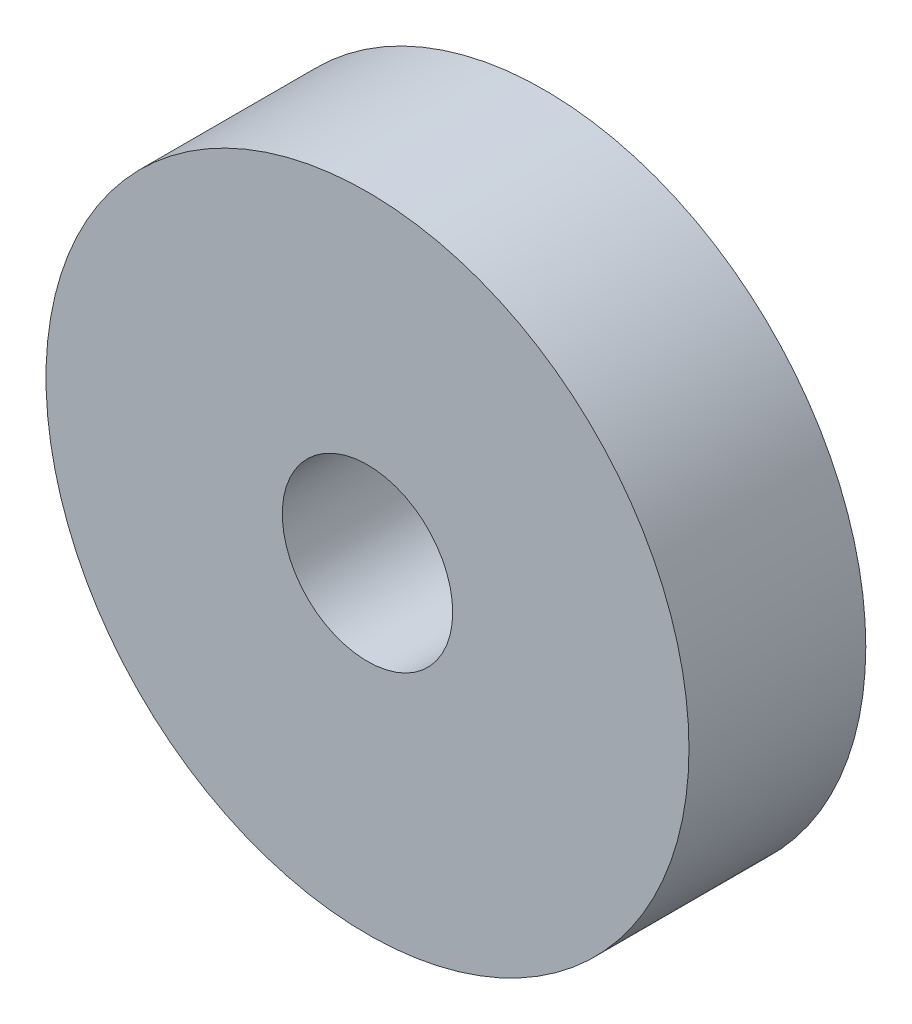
from build123d import *

# Parameters (mm, degrees)
SZKIC1_R                    = 100
SZKIC1_R_2                  = 26.5
DODANIE_WYCI_GNI_CIE1_DEPTH = 55


with BuildPart() as part:
    # Szkic1 → Dodanie-wyci_gni_cie1 (new body)
    with BuildSketch(Plane.XY):
        Circle(SZKIC1_R)
        Circle(SZKIC1_R_2, mode=Mode.SUBTRACT)
    extrude(amount=DODANIE_WYCI_GNI_CIE1_DEPTH)


solid = part.part
